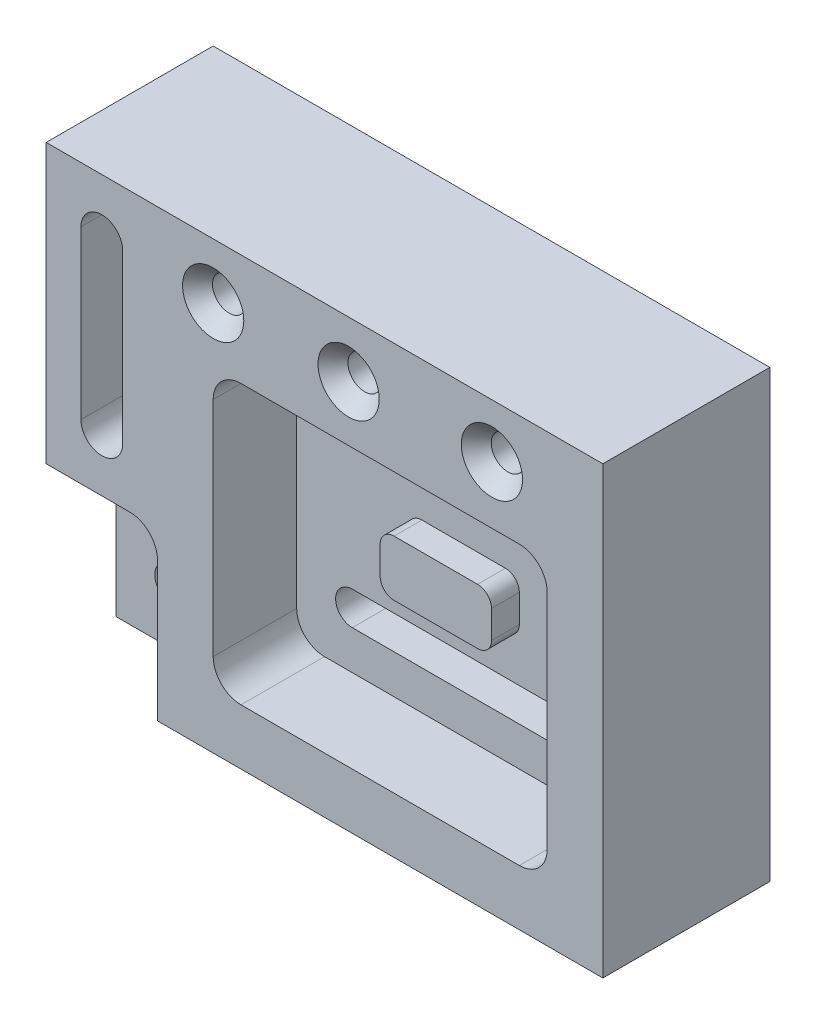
ISO-10303-21;
HEADER;
FILE_DESCRIPTION(('STEP AP214'),'2;1');
FILE_NAME('part.step','',(''),(''),'','','');
FILE_SCHEMA(('AUTOMOTIVE_DESIGN { 1 0 10303 214 1 1 1 1 }'));
ENDSEC;
DATA;
#1=APPLICATION_CONTEXT('core data for automotive mechanical design processes');
#2=APPLICATION_PROTOCOL_DEFINITION('international standard','automotive_design',2000,#1);
#3=PRODUCT_CONTEXT('',#1,'mechanical');
#4=PRODUCT('Part','Part','',(#3));
#5=PRODUCT_RELATED_PRODUCT_CATEGORY('part','',(#4));
#6=PRODUCT_DEFINITION_FORMATION('','',#4);
#7=PRODUCT_DEFINITION_CONTEXT('part definition',#1,'design');
#8=PRODUCT_DEFINITION('design','',#6,#7);
#9=PRODUCT_DEFINITION_SHAPE('','',#8);
#10=(LENGTH_UNIT() NAMED_UNIT(*) SI_UNIT(.MILLI.,.METRE.));
#11=(NAMED_UNIT(*) PLANE_ANGLE_UNIT() SI_UNIT($,.RADIAN.));
#12=(NAMED_UNIT(*) SI_UNIT($,.STERADIAN.) SOLID_ANGLE_UNIT());
#13=UNCERTAINTY_MEASURE_WITH_UNIT(LENGTH_MEASURE(1.E-05),#10,'distance_accuracy_value','');
#14=(GEOMETRIC_REPRESENTATION_CONTEXT(3) GLOBAL_UNCERTAINTY_ASSIGNED_CONTEXT((#13)) GLOBAL_UNIT_ASSIGNED_CONTEXT((#10,
#11,#12)) REPRESENTATION_CONTEXT('',''));
#15=CARTESIAN_POINT('',(0.,0.,0.));
#16=DIRECTION('',(0.,0.,1.));
#17=DIRECTION('',(1.,0.,0.));
#18=AXIS2_PLACEMENT_3D('',#15,#16,#17);
#19=CARTESIAN_POINT('',(70.,30.,-30.));
#20=DIRECTION('',(0.,0.,1.));
#21=DIRECTION('',(1.,0.,0.));
#22=AXIS2_PLACEMENT_3D('',#19,#20,#21);
#23=PLANE('',#22);
#24=CARTESIAN_POINT('',(70.,30.,-30.));
#25=DIRECTION('',(0.,0.,1.));
#26=DIRECTION('',(1.,0.,0.));
#27=AXIS2_PLACEMENT_3D('',#24,#25,#26);
#28=CIRCLE('',#27,10.);
#29=CARTESIAN_POINT('',(80.,29.9999999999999,-30.));
#30=VERTEX_POINT('',#29);
#31=CARTESIAN_POINT('',(69.9999999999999,40.,-30.));
#32=VERTEX_POINT('',#31);
#33=EDGE_CURVE('E890',#30,#32,#28,.T.);
#34=ORIENTED_EDGE('',*,*,#33,.T.);
#35=DIRECTION('',(1.,0.,0.));
#36=VECTOR('',#35,1.);
#37=CARTESIAN_POINT('',(-29.9999999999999,40.,-30.));
#38=LINE('',#37,#36);
#39=CARTESIAN_POINT('',(-29.9999999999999,40.,-30.));
#40=VERTEX_POINT('',#39);
#41=EDGE_CURVE('E896',#40,#32,#38,.T.);
#42=ORIENTED_EDGE('',*,*,#41,.F.);
#43=CARTESIAN_POINT('',(-30.,30.,-30.));
#44=DIRECTION('',(0.,0.,-1.));
#45=DIRECTION('',(-1.,0.,0.));
#46=AXIS2_PLACEMENT_3D('',#43,#44,#45);
#47=CIRCLE('',#46,10.);
#48=CARTESIAN_POINT('',(-40.,29.9999999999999,-30.));
#49=VERTEX_POINT('',#48);
#50=EDGE_CURVE('E947',#49,#40,#47,.T.);
#51=ORIENTED_EDGE('',*,*,#50,.F.);
#52=DIRECTION('',(0.,-1.,0.));
#53=VECTOR('',#52,1.);
#54=CARTESIAN_POINT('',(-40.,29.9999999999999,-30.));
#55=LINE('',#54,#53);
#56=CARTESIAN_POINT('',(-40.,-49.9999999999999,-30.));
#57=VERTEX_POINT('',#56);
#58=EDGE_CURVE('E944',#49,#57,#55,.T.);
#59=ORIENTED_EDGE('',*,*,#58,.T.);
#60=CARTESIAN_POINT('',(-30.,-50.,-30.));
#61=DIRECTION('',(0.,0.,-1.));
#62=DIRECTION('',(-1.,0.,0.));
#63=AXIS2_PLACEMENT_3D('',#60,#61,#62);
#64=CIRCLE('',#63,10.);
#65=CARTESIAN_POINT('',(-29.9999999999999,-60.,-30.));
#66=VERTEX_POINT('',#65);
#67=EDGE_CURVE('E926',#66,#57,#64,.T.);
#68=ORIENTED_EDGE('',*,*,#67,.F.);
#69=DIRECTION('',(-1.,0.,0.));
#70=VECTOR('',#69,1.);
#71=CARTESIAN_POINT('',(69.9999999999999,-60.,-30.));
#72=LINE('',#71,#70);
#73=CARTESIAN_POINT('',(69.9999999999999,-60.,-30.));
#74=VERTEX_POINT('',#73);
#75=EDGE_CURVE('E923',#74,#66,#72,.T.);
#76=ORIENTED_EDGE('',*,*,#75,.F.);
#77=CARTESIAN_POINT('',(70.,-50.,-30.));
#78=DIRECTION('',(0.,0.,-1.));
#79=DIRECTION('',(-1.,0.,0.));
#80=AXIS2_PLACEMENT_3D('',#77,#78,#79);
#81=CIRCLE('',#80,10.);
#82=CARTESIAN_POINT('',(80.,-49.9999999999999,-30.));
#83=VERTEX_POINT('',#82);
#84=EDGE_CURVE('E920',#83,#74,#81,.T.);
#85=ORIENTED_EDGE('',*,*,#84,.F.);
#86=DIRECTION('',(0.,1.,0.));
#87=VECTOR('',#86,1.);
#88=CARTESIAN_POINT('',(80.,-49.9999999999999,-30.));
#89=LINE('',#88,#87);
#90=EDGE_CURVE('E909',#83,#30,#89,.T.);
#91=ORIENTED_EDGE('',*,*,#90,.T.);
#92=EDGE_LOOP('',(#34,#42,#51,#59,#68,#76,#85,#91));
#93=FACE_BOUND('',#92,.T.);
#94=CARTESIAN_POINT('',(-20.,20.,-30.));
#95=DIRECTION('',(0.,0.,1.));
#96=DIRECTION('',(1.,0.,0.));
#97=AXIS2_PLACEMENT_3D('',#94,#95,#96);
#98=CIRCLE('',#97,6.);
#99=CARTESIAN_POINT('',(-20.,26.,-30.));
#100=VERTEX_POINT('',#99);
#101=CARTESIAN_POINT('',(-20.,14.,-30.));
#102=VERTEX_POINT('',#101);
#103=EDGE_CURVE('E703',#100,#102,#98,.T.);
#104=ORIENTED_EDGE('',*,*,#103,.F.);
#105=DIRECTION('',(1.,0.,0.));
#106=VECTOR('',#105,1.);
#107=CARTESIAN_POINT('',(-20.,26.,-30.));
#108=LINE('',#107,#106);
#109=CARTESIAN_POINT('',(60.1483933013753,26.,-30.));
#110=VERTEX_POINT('',#109);
#111=EDGE_CURVE('E678',#100,#110,#108,.T.);
#112=ORIENTED_EDGE('',*,*,#111,.T.);
#113=CARTESIAN_POINT('',(60.1483933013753,20.,-30.));
#114=DIRECTION('',(0.,0.,1.));
#115=DIRECTION('',(1.,0.,0.));
#116=AXIS2_PLACEMENT_3D('',#113,#114,#115);
#117=CIRCLE('',#116,6.);
#118=CARTESIAN_POINT('',(60.1483933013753,14.,-30.));
#119=VERTEX_POINT('',#118);
#120=EDGE_CURVE('E710',#119,#110,#117,.T.);
#121=ORIENTED_EDGE('',*,*,#120,.F.);
#122=DIRECTION('',(1.,0.,0.));
#123=VECTOR('',#122,1.);
#124=CARTESIAN_POINT('',(-20.,14.,-30.));
#125=LINE('',#124,#123);
#126=EDGE_CURVE('E706',#102,#119,#125,.T.);
#127=ORIENTED_EDGE('',*,*,#126,.F.);
#128=EDGE_LOOP('',(#104,#112,#121,#127));
#129=FACE_BOUND('',#128,.T.);
#130=CARTESIAN_POINT('',(-20.,-40.,-30.));
#131=DIRECTION('',(0.,0.,1.));
#132=DIRECTION('',(1.,0.,0.));
#133=AXIS2_PLACEMENT_3D('',#130,#131,#132);
#134=CIRCLE('',#133,6.);
#135=CARTESIAN_POINT('',(-20.,-34.,-30.));
#136=VERTEX_POINT('',#135);
#137=CARTESIAN_POINT('',(-20.,-46.,-30.));
#138=VERTEX_POINT('',#137);
#139=EDGE_CURVE('E283',#136,#138,#134,.T.);
#140=ORIENTED_EDGE('',*,*,#139,.F.);
#141=DIRECTION('',(1.,0.,0.));
#142=VECTOR('',#141,1.);
#143=CARTESIAN_POINT('',(-20.,-34.,-30.));
#144=LINE('',#143,#142);
#145=CARTESIAN_POINT('',(60.1483933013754,-34.,-30.));
#146=VERTEX_POINT('',#145);
#147=EDGE_CURVE('E719',#136,#146,#144,.T.);
#148=ORIENTED_EDGE('',*,*,#147,.T.);
#149=CARTESIAN_POINT('',(60.1483933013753,-40.,-30.));
#150=DIRECTION('',(0.,0.,1.));
#151=DIRECTION('',(1.,0.,0.));
#152=AXIS2_PLACEMENT_3D('',#149,#150,#151);
#153=CIRCLE('',#152,6.00000000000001);
#154=CARTESIAN_POINT('',(60.1483933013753,-46.,-30.));
#155=VERTEX_POINT('',#154);
#156=EDGE_CURVE('E723',#155,#146,#153,.T.);
#157=ORIENTED_EDGE('',*,*,#156,.F.);
#158=DIRECTION('',(1.,0.,0.));
#159=VECTOR('',#158,1.);
#160=CARTESIAN_POINT('',(-20.,-46.,-30.));
#161=LINE('',#160,#159);
#162=EDGE_CURVE('E754',#138,#155,#161,.T.);
#163=ORIENTED_EDGE('',*,*,#162,.F.);
#164=EDGE_LOOP('',(#140,#148,#157,#163));
#165=FACE_BOUND('',#164,.T.);
#166=DIRECTION('',(1.,0.,0.));
#167=VECTOR('',#166,1.);
#168=CARTESIAN_POINT('',(5.00000000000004,0.,-30.));
#169=LINE('',#168,#167);
#170=CARTESIAN_POINT('',(5.00000000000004,0.,-30.));
#171=VERTEX_POINT('',#170);
#172=CARTESIAN_POINT('',(35.,0.,-30.));
#173=VERTEX_POINT('',#172);
#174=EDGE_CURVE('E277',#171,#173,#169,.T.);
#175=ORIENTED_EDGE('',*,*,#174,.T.);
#176=CARTESIAN_POINT('',(35.,-5.,-30.));
#177=DIRECTION('',(0.,0.,1.));
#178=DIRECTION('',(1.,0.,0.));
#179=AXIS2_PLACEMENT_3D('',#176,#177,#178);
#180=CIRCLE('',#179,5.);
#181=CARTESIAN_POINT('',(40.,-5.00000000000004,-30.));
#182=VERTEX_POINT('',#181);
#183=EDGE_CURVE('E288',#182,#173,#180,.T.);
#184=ORIENTED_EDGE('',*,*,#183,.F.);
#185=DIRECTION('',(0.,1.,0.));
#186=VECTOR('',#185,1.);
#187=CARTESIAN_POINT('',(40.,-15.,-30.));
#188=LINE('',#187,#186);
#189=CARTESIAN_POINT('',(40.,-15.,-30.));
#190=VERTEX_POINT('',#189);
#191=EDGE_CURVE('E330',#190,#182,#188,.T.);
#192=ORIENTED_EDGE('',*,*,#191,.F.);
#193=CARTESIAN_POINT('',(35.,-15.,-30.));
#194=DIRECTION('',(0.,0.,-1.));
#195=DIRECTION('',(-1.,0.,0.));
#196=AXIS2_PLACEMENT_3D('',#193,#194,#195);
#197=CIRCLE('',#196,5.);
#198=CARTESIAN_POINT('',(35.,-20.,-30.));
#199=VERTEX_POINT('',#198);
#200=EDGE_CURVE('E54',#190,#199,#197,.T.);
#201=ORIENTED_EDGE('',*,*,#200,.T.);
#202=DIRECTION('',(-1.,0.,0.));
#203=VECTOR('',#202,1.);
#204=CARTESIAN_POINT('',(35.,-20.,-30.));
#205=LINE('',#204,#203);
#206=CARTESIAN_POINT('',(5.00000000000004,-20.,-30.));
#207=VERTEX_POINT('',#206);
#208=EDGE_CURVE('E319',#199,#207,#205,.T.);
#209=ORIENTED_EDGE('',*,*,#208,.T.);
#210=CARTESIAN_POINT('',(5.,-15.,-30.));
#211=DIRECTION('',(0.,0.,-1.));
#212=DIRECTION('',(-1.,0.,0.));
#213=AXIS2_PLACEMENT_3D('',#210,#211,#212);
#214=CIRCLE('',#213,5.);
#215=CARTESIAN_POINT('',(0.,-15.,-30.));
#216=VERTEX_POINT('',#215);
#217=EDGE_CURVE('E315',#207,#216,#214,.T.);
#218=ORIENTED_EDGE('',*,*,#217,.T.);
#219=DIRECTION('',(0.,-1.,0.));
#220=VECTOR('',#219,1.);
#221=CARTESIAN_POINT('',(0.,-5.00000000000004,-30.));
#222=LINE('',#221,#220);
#223=CARTESIAN_POINT('',(0.,-5.00000000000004,-30.));
#224=VERTEX_POINT('',#223);
#225=EDGE_CURVE('E299',#224,#216,#222,.T.);
#226=ORIENTED_EDGE('',*,*,#225,.F.);
#227=CARTESIAN_POINT('',(5.,-5.,-30.));
#228=DIRECTION('',(0.,0.,-1.));
#229=DIRECTION('',(-1.,0.,0.));
#230=AXIS2_PLACEMENT_3D('',#227,#228,#229);
#231=CIRCLE('',#230,5.);
#232=EDGE_CURVE('E297',#224,#171,#231,.T.);
#233=ORIENTED_EDGE('',*,*,#232,.T.);
#234=EDGE_LOOP('',(#175,#184,#192,#201,#209,#218,#226,#233));
#235=FACE_BOUND('',#234,.T.);
#236=ADVANCED_FACE('F39',(#93,#129,#165,#235),#23,.T.);
#237=CARTESIAN_POINT('',(-100.,-80.,0.));
#238=DIRECTION('',(0.,0.,-1.));
#239=DIRECTION('',(-1.,0.,0.));
#240=AXIS2_PLACEMENT_3D('',#237,#238,#239);
#241=PLANE('',#240);
#242=DIRECTION('',(0.,-1.,0.));
#243=VECTOR('',#242,1.);
#244=CARTESIAN_POINT('',(-87.5000000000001,60.,0.));
#245=LINE('',#244,#243);
#246=CARTESIAN_POINT('',(-87.5000000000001,60.,0.));
#247=VERTEX_POINT('',#246);
#248=CARTESIAN_POINT('',(-87.5000000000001,0.,0.));
#249=VERTEX_POINT('',#248);
#250=EDGE_CURVE('E634',#247,#249,#245,.T.);
#251=ORIENTED_EDGE('',*,*,#250,.F.);
#252=CARTESIAN_POINT('',(-80.0000000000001,60.,0.));
#253=DIRECTION('',(0.,0.,1.));
#254=DIRECTION('',(1.,0.,0.));
#255=AXIS2_PLACEMENT_3D('',#252,#253,#254);
#256=CIRCLE('',#255,7.49999999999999);
#257=CARTESIAN_POINT('',(-72.5000000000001,60.,0.));
#258=VERTEX_POINT('',#257);
#259=EDGE_CURVE('E630',#258,#247,#256,.T.);
#260=ORIENTED_EDGE('',*,*,#259,.F.);
#261=DIRECTION('',(0.,-1.,0.));
#262=VECTOR('',#261,1.);
#263=CARTESIAN_POINT('',(-72.5000000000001,60.,0.));
#264=LINE('',#263,#262);
#265=CARTESIAN_POINT('',(-72.5,0.,0.));
#266=VERTEX_POINT('',#265);
#267=EDGE_CURVE('E655',#258,#266,#264,.T.);
#268=ORIENTED_EDGE('',*,*,#267,.T.);
#269=CARTESIAN_POINT('',(-80.,0.,0.));
#270=DIRECTION('',(0.,0.,1.));
#271=DIRECTION('',(1.,0.,0.));
#272=AXIS2_PLACEMENT_3D('',#269,#270,#271);
#273=CIRCLE('',#272,7.50000000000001);
#274=EDGE_CURVE('E642',#249,#266,#273,.T.);
#275=ORIENTED_EDGE('',*,*,#274,.F.);
#276=EDGE_LOOP('',(#251,#260,#268,#275));
#277=FACE_BOUND('',#276,.T.);
#278=CARTESIAN_POINT('',(8.66393965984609,59.8722747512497,-5.6843418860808E-11));
#279=DIRECTION('',(0.,0.,1.));
#280=DIRECTION('',(1.,0.,0.));
#281=AXIS2_PLACEMENT_3D('',#278,#279,#280);
#282=CIRCLE('',#281,11.);
#283=CARTESIAN_POINT('',(19.6639396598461,59.8722747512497,-5.6843418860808E-11));
#284=VERTEX_POINT('',#283);
#285=EDGE_CURVE('E584',#284,#284,#282,.T.);
#286=ORIENTED_EDGE('',*,*,#285,.F.);
#287=EDGE_LOOP('',(#286));
#288=FACE_BOUND('',#287,.T.);
#289=DIRECTION('',(1.,0.,0.));
#290=VECTOR('',#289,1.);
#291=CARTESIAN_POINT('',(-120.,-20.,0.));
#292=LINE('',#291,#290);
#293=CARTESIAN_POINT('',(-100.,-20.,0.));
#294=VERTEX_POINT('',#293);
#295=CARTESIAN_POINT('',(-70.0000000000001,-20.,0.));
#296=VERTEX_POINT('',#295);
#297=EDGE_CURVE('E560',#294,#296,#292,.T.);
#298=ORIENTED_EDGE('',*,*,#297,.T.);
#299=CARTESIAN_POINT('',(-70.,-30.,0.));
#300=DIRECTION('',(0.,0.,1.));
#301=DIRECTION('',(1.,0.,0.));
#302=AXIS2_PLACEMENT_3D('',#299,#300,#301);
#303=CIRCLE('',#302,10.);
#304=CARTESIAN_POINT('',(-60.,-30.0000000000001,0.));
#305=VERTEX_POINT('',#304);
#306=EDGE_CURVE('E553',#305,#296,#303,.T.);
#307=ORIENTED_EDGE('',*,*,#306,.F.);
#308=DIRECTION('',(0.,1.,0.));
#309=VECTOR('',#308,1.);
#310=CARTESIAN_POINT('',(-60.,-100.,0.));
#311=LINE('',#310,#309);
#312=CARTESIAN_POINT('',(-60.,-80.,0.));
#313=VERTEX_POINT('',#312);
#314=EDGE_CURVE('E549',#313,#305,#311,.T.);
#315=ORIENTED_EDGE('',*,*,#314,.F.);
#316=DIRECTION('',(-1.,0.,0.));
#317=VECTOR('',#316,1.);
#318=CARTESIAN_POINT('',(100.,-80.,0.));
#319=LINE('',#318,#317);
#320=CARTESIAN_POINT('',(100.,-80.,0.));
#321=VERTEX_POINT('',#320);
#322=EDGE_CURVE('E496',#321,#313,#319,.T.);
#323=ORIENTED_EDGE('',*,*,#322,.F.);
#324=DIRECTION('',(0.,1.,0.));
#325=VECTOR('',#324,1.);
#326=CARTESIAN_POINT('',(100.,-80.,0.));
#327=LINE('',#326,#325);
#328=CARTESIAN_POINT('',(100.,80.,0.));
#329=VERTEX_POINT('',#328);
#330=EDGE_CURVE('E505',#321,#329,#327,.T.);
#331=ORIENTED_EDGE('',*,*,#330,.T.);
#332=DIRECTION('',(1.,0.,0.));
#333=VECTOR('',#332,1.);
#334=CARTESIAN_POINT('',(-100.,80.,0.));
#335=LINE('',#334,#333);
#336=CARTESIAN_POINT('',(-100.,80.,0.));
#337=VERTEX_POINT('',#336);
#338=EDGE_CURVE('E509',#337,#329,#335,.T.);
#339=ORIENTED_EDGE('',*,*,#338,.F.);
#340=DIRECTION('',(0.,-1.,0.));
#341=VECTOR('',#340,1.);
#342=CARTESIAN_POINT('',(-100.,80.,0.));
#343=LINE('',#342,#341);
#344=EDGE_CURVE('E506',#337,#294,#343,.T.);
#345=ORIENTED_EDGE('',*,*,#344,.T.);
#346=EDGE_LOOP('',(#298,#307,#315,#323,#331,#339,#345));
#347=FACE_BOUND('',#346,.T.);
#348=DIRECTION('',(1.,0.,0.));
#349=VECTOR('',#348,1.);
#350=CARTESIAN_POINT('',(-29.9999999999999,40.,0.));
#351=LINE('',#350,#349);
#352=CARTESIAN_POINT('',(-29.9999999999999,40.,0.));
#353=VERTEX_POINT('',#352);
#354=CARTESIAN_POINT('',(69.9999999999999,40.,0.));
#355=VERTEX_POINT('',#354);
#356=EDGE_CURVE('E531',#353,#355,#351,.T.);
#357=ORIENTED_EDGE('',*,*,#356,.T.);
#358=CARTESIAN_POINT('',(70.,30.,0.));
#359=DIRECTION('',(0.,0.,1.));
#360=DIRECTION('',(1.,0.,0.));
#361=AXIS2_PLACEMENT_3D('',#358,#359,#360);
#362=CIRCLE('',#361,10.);
#363=CARTESIAN_POINT('',(80.,29.9999999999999,0.));
#364=VERTEX_POINT('',#363);
#365=EDGE_CURVE('E527',#364,#355,#362,.T.);
#366=ORIENTED_EDGE('',*,*,#365,.F.);
#367=DIRECTION('',(0.,1.,0.));
#368=VECTOR('',#367,1.);
#369=CARTESIAN_POINT('',(80.,-49.9999999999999,0.));
#370=LINE('',#369,#368);
#371=CARTESIAN_POINT('',(80.,-49.9999999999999,0.));
#372=VERTEX_POINT('',#371);
#373=EDGE_CURVE('E885',#372,#364,#370,.T.);
#374=ORIENTED_EDGE('',*,*,#373,.F.);
#375=CARTESIAN_POINT('',(70.,-50.,0.));
#376=DIRECTION('',(0.,0.,-1.));
#377=DIRECTION('',(-1.,0.,0.));
#378=AXIS2_PLACEMENT_3D('',#375,#376,#377);
#379=CIRCLE('',#378,10.);
#380=CARTESIAN_POINT('',(69.9999999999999,-60.,0.));
#381=VERTEX_POINT('',#380);
#382=EDGE_CURVE('E891',#372,#381,#379,.T.);
#383=ORIENTED_EDGE('',*,*,#382,.T.);
#384=DIRECTION('',(-1.,0.,0.));
#385=VECTOR('',#384,1.);
#386=CARTESIAN_POINT('',(69.9999999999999,-60.,0.));
#387=LINE('',#386,#385);
#388=CARTESIAN_POINT('',(-29.9999999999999,-60.,0.));
#389=VERTEX_POINT('',#388);
#390=EDGE_CURVE('E985',#381,#389,#387,.T.);
#391=ORIENTED_EDGE('',*,*,#390,.T.);
#392=CARTESIAN_POINT('',(-30.,-50.,0.));
#393=DIRECTION('',(0.,0.,-1.));
#394=DIRECTION('',(-1.,0.,0.));
#395=AXIS2_PLACEMENT_3D('',#392,#393,#394);
#396=CIRCLE('',#395,10.);
#397=CARTESIAN_POINT('',(-40.,-49.9999999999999,0.));
#398=VERTEX_POINT('',#397);
#399=EDGE_CURVE('E981',#389,#398,#396,.T.);
#400=ORIENTED_EDGE('',*,*,#399,.T.);
#401=DIRECTION('',(0.,-1.,0.));
#402=VECTOR('',#401,1.);
#403=CARTESIAN_POINT('',(-40.,29.9999999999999,0.));
#404=LINE('',#403,#402);
#405=CARTESIAN_POINT('',(-40.,29.9999999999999,0.));
#406=VERTEX_POINT('',#405);
#407=EDGE_CURVE('E977',#406,#398,#404,.T.);
#408=ORIENTED_EDGE('',*,*,#407,.F.);
#409=CARTESIAN_POINT('',(-30.,30.,0.));
#410=DIRECTION('',(0.,0.,-1.));
#411=DIRECTION('',(-1.,0.,0.));
#412=AXIS2_PLACEMENT_3D('',#409,#410,#411);
#413=CIRCLE('',#412,10.);
#414=EDGE_CURVE('E538',#406,#353,#413,.T.);
#415=ORIENTED_EDGE('',*,*,#414,.T.);
#416=EDGE_LOOP('',(#357,#366,#374,#383,#391,#400,#408,#415));
#417=FACE_BOUND('',#416,.T.);
#418=CARTESIAN_POINT('',(-40.,60.,0.));
#419=DIRECTION('',(0.,0.,1.));
#420=DIRECTION('',(1.,0.,0.));
#421=AXIS2_PLACEMENT_3D('',#418,#419,#420);
#422=CIRCLE('',#421,11.);
#423=CARTESIAN_POINT('',(-29.,60.,0.));
#424=VERTEX_POINT('',#423);
#425=EDGE_CURVE('E570',#424,#424,#422,.T.);
#426=ORIENTED_EDGE('',*,*,#425,.F.);
#427=EDGE_LOOP('',(#426));
#428=FACE_BOUND('',#427,.T.);
#429=CARTESIAN_POINT('',(60.1483933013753,60.6571498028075,0.));
#430=DIRECTION('',(0.,0.,1.));
#431=DIRECTION('',(1.,0.,0.));
#432=AXIS2_PLACEMENT_3D('',#429,#430,#431);
#433=CIRCLE('',#432,11.);
#434=CARTESIAN_POINT('',(71.1483933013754,60.6571498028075,0.));
#435=VERTEX_POINT('',#434);
#436=EDGE_CURVE('E598',#435,#435,#433,.T.);
#437=ORIENTED_EDGE('',*,*,#436,.F.);
#438=EDGE_LOOP('',(#437));
#439=FACE_BOUND('',#438,.T.);
#440=ADVANCED_FACE('F431',(#277,#288,#347,#417,#428,#439),#241,.F.);
#441=CARTESIAN_POINT('',(-100.,-80.,-60.));
#442=DIRECTION('',(0.,0.,-1.));
#443=DIRECTION('',(-1.,0.,0.));
#444=AXIS2_PLACEMENT_3D('',#441,#442,#443);
#445=PLANE('',#444);
#446=CARTESIAN_POINT('',(-20.,-40.,-60.0000000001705));
#447=DIRECTION('',(0.,0.,1.));
#448=DIRECTION('',(1.,0.,0.));
#449=AXIS2_PLACEMENT_3D('',#446,#447,#448);
#450=CIRCLE('',#449,6.);
#451=CARTESIAN_POINT('',(-20.,-34.,-60.0000000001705));
#452=VERTEX_POINT('',#451);
#453=CARTESIAN_POINT('',(-20.,-46.,-60.0000000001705));
#454=VERTEX_POINT('',#453);
#455=EDGE_CURVE('E722',#452,#454,#450,.T.);
#456=ORIENTED_EDGE('',*,*,#455,.T.);
#457=DIRECTION('',(1.,0.,0.));
#458=VECTOR('',#457,1.);
#459=CARTESIAN_POINT('',(-20.,-46.,-60.0000000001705));
#460=LINE('',#459,#458);
#461=CARTESIAN_POINT('',(60.1483933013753,-46.,-60.));
#462=VERTEX_POINT('',#461);
#463=EDGE_CURVE('E727',#454,#462,#460,.T.);
#464=ORIENTED_EDGE('',*,*,#463,.T.);
#465=CARTESIAN_POINT('',(60.1483933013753,-40.,-60.0000000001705));
#466=DIRECTION('',(0.,0.,1.));
#467=DIRECTION('',(1.,0.,0.));
#468=AXIS2_PLACEMENT_3D('',#465,#466,#467);
#469=CIRCLE('',#468,6.00000000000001);
#470=CARTESIAN_POINT('',(60.1483933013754,-34.,-60.0000000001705));
#471=VERTEX_POINT('',#470);
#472=EDGE_CURVE('E62',#462,#471,#469,.T.);
#473=ORIENTED_EDGE('',*,*,#472,.T.);
#474=DIRECTION('',(1.,0.,0.));
#475=VECTOR('',#474,1.);
#476=CARTESIAN_POINT('',(-20.,-34.,-60.0000000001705));
#477=LINE('',#476,#475);
#478=EDGE_CURVE('E700',#452,#471,#477,.T.);
#479=ORIENTED_EDGE('',*,*,#478,.F.);
#480=EDGE_LOOP('',(#456,#464,#473,#479));
#481=FACE_BOUND('',#480,.T.);
#482=CARTESIAN_POINT('',(-20.,20.,-60.0000000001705));
#483=DIRECTION('',(0.,0.,1.));
#484=DIRECTION('',(1.,0.,0.));
#485=AXIS2_PLACEMENT_3D('',#482,#483,#484);
#486=CIRCLE('',#485,6.);
#487=CARTESIAN_POINT('',(-20.,26.,-60.0000000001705));
#488=VERTEX_POINT('',#487);
#489=CARTESIAN_POINT('',(-20.,14.,-60.0000000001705));
#490=VERTEX_POINT('',#489);
#491=EDGE_CURVE('E672',#488,#490,#486,.T.);
#492=ORIENTED_EDGE('',*,*,#491,.T.);
#493=DIRECTION('',(1.,0.,0.));
#494=VECTOR('',#493,1.);
#495=CARTESIAN_POINT('',(-20.,14.,-60.0000000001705));
#496=LINE('',#495,#494);
#497=CARTESIAN_POINT('',(60.1483933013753,14.,-60.));
#498=VERTEX_POINT('',#497);
#499=EDGE_CURVE('E677',#490,#498,#496,.T.);
#500=ORIENTED_EDGE('',*,*,#499,.T.);
#501=CARTESIAN_POINT('',(60.1483933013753,20.,-60.0000000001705));
#502=DIRECTION('',(0.,0.,1.));
#503=DIRECTION('',(1.,0.,0.));
#504=AXIS2_PLACEMENT_3D('',#501,#502,#503);
#505=CIRCLE('',#504,6.);
#506=CARTESIAN_POINT('',(60.1483933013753,26.,-60.0000000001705));
#507=VERTEX_POINT('',#506);
#508=EDGE_CURVE('E684',#498,#507,#505,.T.);
#509=ORIENTED_EDGE('',*,*,#508,.T.);
#510=DIRECTION('',(1.,0.,0.));
#511=VECTOR('',#510,1.);
#512=CARTESIAN_POINT('',(-20.,26.,-60.0000000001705));
#513=LINE('',#512,#511);
#514=EDGE_CURVE('E1457',#488,#507,#513,.T.);
#515=ORIENTED_EDGE('',*,*,#514,.F.);
#516=EDGE_LOOP('',(#492,#500,#509,#515));
#517=FACE_BOUND('',#516,.T.);
#518=CARTESIAN_POINT('',(-80.,-60.,-60.0000000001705));
#519=DIRECTION('',(0.,0.,1.));
#520=DIRECTION('',(1.,0.,0.));
#521=AXIS2_PLACEMENT_3D('',#518,#519,#520);
#522=CIRCLE('',#521,6.);
#523=CARTESIAN_POINT('',(-74.,-60.,-60.0000000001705));
#524=VERTEX_POINT('',#523);
#525=EDGE_CURVE('E613',#524,#524,#522,.T.);
#526=ORIENTED_EDGE('',*,*,#525,.T.);
#527=EDGE_LOOP('',(#526));
#528=FACE_BOUND('',#527,.T.);
#529=CARTESIAN_POINT('',(-80.,-33.3333333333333,-60.0000000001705));
#530=DIRECTION('',(0.,0.,1.));
#531=DIRECTION('',(1.,0.,0.));
#532=AXIS2_PLACEMENT_3D('',#529,#530,#531);
#533=CIRCLE('',#532,6.);
#534=CARTESIAN_POINT('',(-74.,-33.3333333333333,-60.0000000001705));
#535=VERTEX_POINT('',#534);
#536=EDGE_CURVE('E602',#535,#535,#533,.T.);
#537=ORIENTED_EDGE('',*,*,#536,.T.);
#538=EDGE_LOOP('',(#537));
#539=FACE_BOUND('',#538,.T.);
#540=CARTESIAN_POINT('',(8.66393965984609,59.8722747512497,-60.0000000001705));
#541=DIRECTION('',(0.,0.,1.));
#542=DIRECTION('',(1.,0.,0.));
#543=AXIS2_PLACEMENT_3D('',#540,#541,#542);
#544=CIRCLE('',#543,6.);
#545=CARTESIAN_POINT('',(14.6639396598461,59.8722747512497,-60.0000000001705));
#546=VERTEX_POINT('',#545);
#547=EDGE_CURVE('E574',#546,#546,#544,.T.);
#548=ORIENTED_EDGE('',*,*,#547,.T.);
#549=EDGE_LOOP('',(#548));
#550=FACE_BOUND('',#549,.T.);
#551=DIRECTION('',(0.,-1.,0.));
#552=VECTOR('',#551,1.);
#553=CARTESIAN_POINT('',(-100.,80.,-60.));
#554=LINE('',#553,#552);
#555=CARTESIAN_POINT('',(-100.,80.,-60.));
#556=VERTEX_POINT('',#555);
#557=CARTESIAN_POINT('',(-100.,-80.,-60.));
#558=VERTEX_POINT('',#557);
#559=EDGE_CURVE('E775',#556,#558,#554,.T.);
#560=ORIENTED_EDGE('',*,*,#559,.F.);
#561=DIRECTION('',(1.,0.,0.));
#562=VECTOR('',#561,1.);
#563=CARTESIAN_POINT('',(-100.,80.,-60.));
#564=LINE('',#563,#562);
#565=CARTESIAN_POINT('',(100.,80.,-60.));
#566=VERTEX_POINT('',#565);
#567=EDGE_CURVE('E866',#556,#566,#564,.T.);
#568=ORIENTED_EDGE('',*,*,#567,.T.);
#569=DIRECTION('',(0.,1.,0.));
#570=VECTOR('',#569,1.);
#571=CARTESIAN_POINT('',(100.,-80.,-60.));
#572=LINE('',#571,#570);
#573=CARTESIAN_POINT('',(100.,-80.,-60.));
#574=VERTEX_POINT('',#573);
#575=EDGE_CURVE('E1005',#574,#566,#572,.T.);
#576=ORIENTED_EDGE('',*,*,#575,.F.);
#577=DIRECTION('',(-1.,0.,0.));
#578=VECTOR('',#577,1.);
#579=CARTESIAN_POINT('',(100.,-80.,-60.));
#580=LINE('',#579,#578);
#581=EDGE_CURVE('E1010',#574,#558,#580,.T.);
#582=ORIENTED_EDGE('',*,*,#581,.T.);
#583=EDGE_LOOP('',(#560,#568,#576,#582));
#584=FACE_BOUND('',#583,.T.);
#585=CARTESIAN_POINT('',(-40.,60.,-60.0000000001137));
#586=DIRECTION('',(0.,0.,1.));
#587=DIRECTION('',(1.,0.,0.));
#588=AXIS2_PLACEMENT_3D('',#585,#586,#587);
#589=CIRCLE('',#588,6.);
#590=CARTESIAN_POINT('',(-34.,60.,-60.0000000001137));
#591=VERTEX_POINT('',#590);
#592=EDGE_CURVE('E554',#591,#591,#589,.T.);
#593=ORIENTED_EDGE('',*,*,#592,.T.);
#594=EDGE_LOOP('',(#593));
#595=FACE_BOUND('',#594,.T.);
#596=CARTESIAN_POINT('',(60.1483933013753,60.6571498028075,-60.0000000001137));
#597=DIRECTION('',(0.,0.,1.));
#598=DIRECTION('',(1.,0.,0.));
#599=AXIS2_PLACEMENT_3D('',#596,#597,#598);
#600=CIRCLE('',#599,6.);
#601=CARTESIAN_POINT('',(66.1483933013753,60.6571498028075,-60.0000000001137));
#602=VERTEX_POINT('',#601);
#603=EDGE_CURVE('E588',#602,#602,#600,.T.);
#604=ORIENTED_EDGE('',*,*,#603,.T.);
#605=EDGE_LOOP('',(#604));
#606=FACE_BOUND('',#605,.T.);
#607=ADVANCED_FACE('F437',(#481,#517,#528,#539,#550,#584,#595,#606),#445,.T.);
#608=CARTESIAN_POINT('',(-100.,80.,-60.));
#609=DIRECTION('',(-1.,0.,0.));
#610=DIRECTION('',(0.,0.,1.));
#611=AXIS2_PLACEMENT_3D('',#608,#609,#610);
#612=PLANE('',#611);
#613=DIRECTION('',(0.,1.,0.));
#614=VECTOR('',#613,1.);
#615=CARTESIAN_POINT('',(-100.,80.,-25.));
#616=LINE('',#615,#614);
#617=CARTESIAN_POINT('',(-100.,-80.,-25.));
#618=VERTEX_POINT('',#617);
#619=CARTESIAN_POINT('',(-100.,-20.,-25.));
#620=VERTEX_POINT('',#619);
#621=EDGE_CURVE('E532',#618,#620,#616,.T.);
#622=ORIENTED_EDGE('',*,*,#621,.T.);
#623=DIRECTION('',(0.,0.,1.));
#624=VECTOR('',#623,1.);
#625=CARTESIAN_POINT('',(-100.,-20.,-60.));
#626=LINE('',#625,#624);
#627=EDGE_CURVE('E854',#620,#294,#626,.T.);
#628=ORIENTED_EDGE('',*,*,#627,.T.);
#629=ORIENTED_EDGE('',*,*,#344,.F.);
#630=DIRECTION('',(0.,0.,1.));
#631=VECTOR('',#630,1.);
#632=CARTESIAN_POINT('',(-100.,80.,-60.));
#633=LINE('',#632,#631);
#634=EDGE_CURVE('E47',#556,#337,#633,.T.);
#635=ORIENTED_EDGE('',*,*,#634,.F.);
#636=ORIENTED_EDGE('',*,*,#559,.T.);
#637=DIRECTION('',(0.,0.,1.));
#638=VECTOR('',#637,1.);
#639=CARTESIAN_POINT('',(-100.,-80.,-60.));
#640=LINE('',#639,#638);
#641=EDGE_CURVE('E999',#558,#618,#640,.T.);
#642=ORIENTED_EDGE('',*,*,#641,.T.);
#643=EDGE_LOOP('',(#622,#628,#629,#635,#636,#642));
#644=FACE_BOUND('',#643,.T.);
#645=ADVANCED_FACE('F41',(#644),#612,.T.);
#646=CARTESIAN_POINT('',(-100.,80.,-60.));
#647=DIRECTION('',(0.,-1.,0.));
#648=DIRECTION('',(0.,0.,-1.));
#649=AXIS2_PLACEMENT_3D('',#646,#647,#648);
#650=PLANE('',#649);
#651=ORIENTED_EDGE('',*,*,#338,.T.);
#652=DIRECTION('',(0.,0.,1.));
#653=VECTOR('',#652,1.);
#654=CARTESIAN_POINT('',(100.,80.,-60.));
#655=LINE('',#654,#653);
#656=EDGE_CURVE('E865',#566,#329,#655,.T.);
#657=ORIENTED_EDGE('',*,*,#656,.F.);
#658=ORIENTED_EDGE('',*,*,#567,.F.);
#659=ORIENTED_EDGE('',*,*,#634,.T.);
#660=EDGE_LOOP('',(#651,#657,#658,#659));
#661=FACE_BOUND('',#660,.T.);
#662=ADVANCED_FACE('F482',(#661),#650,.F.);
#663=CARTESIAN_POINT('',(100.,-80.,-60.));
#664=DIRECTION('',(1.,0.,0.));
#665=DIRECTION('',(0.,0.,-1.));
#666=AXIS2_PLACEMENT_3D('',#663,#664,#665);
#667=PLANE('',#666);
#668=ORIENTED_EDGE('',*,*,#330,.F.);
#669=DIRECTION('',(0.,0.,1.));
#670=VECTOR('',#669,1.);
#671=CARTESIAN_POINT('',(100.,-80.,-60.));
#672=LINE('',#671,#670);
#673=EDGE_CURVE('E500',#574,#321,#672,.T.);
#674=ORIENTED_EDGE('',*,*,#673,.F.);
#675=ORIENTED_EDGE('',*,*,#575,.T.);
#676=ORIENTED_EDGE('',*,*,#656,.T.);
#677=EDGE_LOOP('',(#668,#674,#675,#676));
#678=FACE_BOUND('',#677,.T.);
#679=ADVANCED_FACE('F485',(#678),#667,.T.);
#680=CARTESIAN_POINT('',(100.,-80.,-60.));
#681=DIRECTION('',(0.,1.,0.));
#682=DIRECTION('',(0.,0.,1.));
#683=AXIS2_PLACEMENT_3D('',#680,#681,#682);
#684=PLANE('',#683);
#685=ORIENTED_EDGE('',*,*,#322,.T.);
#686=DIRECTION('',(0.,0.,-1.));
#687=VECTOR('',#686,1.);
#688=CARTESIAN_POINT('',(-60.,-80.,-60.));
#689=LINE('',#688,#687);
#690=CARTESIAN_POINT('',(-60.,-80.,-25.));
#691=VERTEX_POINT('',#690);
#692=EDGE_CURVE('E498',#313,#691,#689,.T.);
#693=ORIENTED_EDGE('',*,*,#692,.T.);
#694=DIRECTION('',(1.,0.,0.));
#695=VECTOR('',#694,1.);
#696=CARTESIAN_POINT('',(100.,-80.,-25.));
#697=LINE('',#696,#695);
#698=EDGE_CURVE('E12',#618,#691,#697,.T.);
#699=ORIENTED_EDGE('',*,*,#698,.F.);
#700=ORIENTED_EDGE('',*,*,#641,.F.);
#701=ORIENTED_EDGE('',*,*,#581,.F.);
#702=ORIENTED_EDGE('',*,*,#673,.T.);
#703=EDGE_LOOP('',(#685,#693,#699,#700,#701,#702));
#704=FACE_BOUND('',#703,.T.);
#705=ADVANCED_FACE('F476',(#704),#684,.F.);
#706=CARTESIAN_POINT('',(70.,30.,-30.));
#707=DIRECTION('',(0.,0.,1.));
#708=DIRECTION('',(1.,0.,0.));
#709=AXIS2_PLACEMENT_3D('',#706,#707,#708);
#710=CYLINDRICAL_SURFACE('',#709,10.);
#711=ORIENTED_EDGE('',*,*,#365,.T.);
#712=DIRECTION('',(0.,0.,1.));
#713=VECTOR('',#712,1.);
#714=CARTESIAN_POINT('',(69.9999999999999,40.,-30.));
#715=LINE('',#714,#713);
#716=EDGE_CURVE('E952',#32,#355,#715,.T.);
#717=ORIENTED_EDGE('',*,*,#716,.F.);
#718=ORIENTED_EDGE('',*,*,#33,.F.);
#719=DIRECTION('',(0.,0.,1.));
#720=VECTOR('',#719,1.);
#721=CARTESIAN_POINT('',(80.,29.9999999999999,-30.));
#722=LINE('',#721,#720);
#723=EDGE_CURVE('E512',#30,#364,#722,.T.);
#724=ORIENTED_EDGE('',*,*,#723,.T.);
#725=EDGE_LOOP('',(#711,#717,#718,#724));
#726=FACE_BOUND('',#725,.T.);
#727=ADVANCED_FACE('F450',(#726),#710,.F.);
#728=CARTESIAN_POINT('',(80.,-49.9999999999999,-30.));
#729=DIRECTION('',(1.,0.,0.));
#730=DIRECTION('',(0.,0.,-1.));
#731=AXIS2_PLACEMENT_3D('',#728,#729,#730);
#732=PLANE('',#731);
#733=ORIENTED_EDGE('',*,*,#373,.T.);
#734=ORIENTED_EDGE('',*,*,#723,.F.);
#735=ORIENTED_EDGE('',*,*,#90,.F.);
#736=DIRECTION('',(0.,0.,1.));
#737=VECTOR('',#736,1.);
#738=CARTESIAN_POINT('',(80.,-49.9999999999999,-30.));
#739=LINE('',#738,#737);
#740=EDGE_CURVE('E908',#83,#372,#739,.T.);
#741=ORIENTED_EDGE('',*,*,#740,.T.);
#742=EDGE_LOOP('',(#733,#734,#735,#741));
#743=FACE_BOUND('',#742,.T.);
#744=ADVANCED_FACE('F446',(#743),#732,.F.);
#745=CARTESIAN_POINT('',(70.,-50.,-30.));
#746=DIRECTION('',(0.,0.,1.));
#747=DIRECTION('',(1.,0.,0.));
#748=AXIS2_PLACEMENT_3D('',#745,#746,#747);
#749=CYLINDRICAL_SURFACE('',#748,10.);
#750=ORIENTED_EDGE('',*,*,#382,.F.);
#751=ORIENTED_EDGE('',*,*,#740,.F.);
#752=ORIENTED_EDGE('',*,*,#84,.T.);
#753=DIRECTION('',(0.,0.,1.));
#754=VECTOR('',#753,1.);
#755=CARTESIAN_POINT('',(69.9999999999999,-60.,-30.));
#756=LINE('',#755,#754);
#757=EDGE_CURVE('E914',#74,#381,#756,.T.);
#758=ORIENTED_EDGE('',*,*,#757,.T.);
#759=EDGE_LOOP('',(#750,#751,#752,#758));
#760=FACE_BOUND('',#759,.T.);
#761=ADVANCED_FACE('F449',(#760),#749,.F.);
#762=CARTESIAN_POINT('',(69.9999999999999,-60.,-30.));
#763=DIRECTION('',(0.,1.,0.));
#764=DIRECTION('',(0.,0.,1.));
#765=AXIS2_PLACEMENT_3D('',#762,#763,#764);
#766=PLANE('',#765);
#767=ORIENTED_EDGE('',*,*,#390,.F.);
#768=ORIENTED_EDGE('',*,*,#757,.F.);
#769=ORIENTED_EDGE('',*,*,#75,.T.);
#770=DIRECTION('',(0.,0.,1.));
#771=VECTOR('',#770,1.);
#772=CARTESIAN_POINT('',(-29.9999999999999,-60.,-30.));
#773=LINE('',#772,#771);
#774=EDGE_CURVE('E932',#66,#389,#773,.T.);
#775=ORIENTED_EDGE('',*,*,#774,.T.);
#776=EDGE_LOOP('',(#767,#768,#769,#775));
#777=FACE_BOUND('',#776,.T.);
#778=ADVANCED_FACE('F454',(#777),#766,.T.);
#779=CARTESIAN_POINT('',(-30.,-50.,-30.));
#780=DIRECTION('',(0.,0.,1.));
#781=DIRECTION('',(1.,0.,0.));
#782=AXIS2_PLACEMENT_3D('',#779,#780,#781);
#783=CYLINDRICAL_SURFACE('',#782,10.);
#784=ORIENTED_EDGE('',*,*,#399,.F.);
#785=ORIENTED_EDGE('',*,*,#774,.F.);
#786=ORIENTED_EDGE('',*,*,#67,.T.);
#787=DIRECTION('',(0.,0.,1.));
#788=VECTOR('',#787,1.);
#789=CARTESIAN_POINT('',(-40.,-49.9999999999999,-30.));
#790=LINE('',#789,#788);
#791=EDGE_CURVE('E935',#57,#398,#790,.T.);
#792=ORIENTED_EDGE('',*,*,#791,.T.);
#793=EDGE_LOOP('',(#784,#785,#786,#792));
#794=FACE_BOUND('',#793,.T.);
#795=ADVANCED_FACE('F458',(#794),#783,.F.);
#796=CARTESIAN_POINT('',(-40.,29.9999999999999,-30.));
#797=DIRECTION('',(-1.,0.,0.));
#798=DIRECTION('',(0.,0.,1.));
#799=AXIS2_PLACEMENT_3D('',#796,#797,#798);
#800=PLANE('',#799);
#801=ORIENTED_EDGE('',*,*,#407,.T.);
#802=ORIENTED_EDGE('',*,*,#791,.F.);
#803=ORIENTED_EDGE('',*,*,#58,.F.);
#804=DIRECTION('',(0.,0.,1.));
#805=VECTOR('',#804,1.);
#806=CARTESIAN_POINT('',(-40.,29.9999999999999,-30.));
#807=LINE('',#806,#805);
#808=EDGE_CURVE('E938',#49,#406,#807,.T.);
#809=ORIENTED_EDGE('',*,*,#808,.T.);
#810=EDGE_LOOP('',(#801,#802,#803,#809));
#811=FACE_BOUND('',#810,.T.);
#812=ADVANCED_FACE('F462',(#811),#800,.F.);
#813=CARTESIAN_POINT('',(-30.,30.,-30.));
#814=DIRECTION('',(0.,0.,1.));
#815=DIRECTION('',(1.,0.,0.));
#816=AXIS2_PLACEMENT_3D('',#813,#814,#815);
#817=CYLINDRICAL_SURFACE('',#816,10.);
#818=ORIENTED_EDGE('',*,*,#414,.F.);
#819=ORIENTED_EDGE('',*,*,#808,.F.);
#820=ORIENTED_EDGE('',*,*,#50,.T.);
#821=DIRECTION('',(0.,0.,1.));
#822=VECTOR('',#821,1.);
#823=CARTESIAN_POINT('',(-29.9999999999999,40.,-30.));
#824=LINE('',#823,#822);
#825=EDGE_CURVE('E950',#40,#353,#824,.T.);
#826=ORIENTED_EDGE('',*,*,#825,.T.);
#827=EDGE_LOOP('',(#818,#819,#820,#826));
#828=FACE_BOUND('',#827,.T.);
#829=ADVANCED_FACE('F466',(#828),#817,.F.);
#830=CARTESIAN_POINT('',(-29.9999999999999,40.,-30.));
#831=DIRECTION('',(0.,-1.,0.));
#832=DIRECTION('',(0.,0.,-1.));
#833=AXIS2_PLACEMENT_3D('',#830,#831,#832);
#834=PLANE('',#833);
#835=ORIENTED_EDGE('',*,*,#356,.F.);
#836=ORIENTED_EDGE('',*,*,#825,.F.);
#837=ORIENTED_EDGE('',*,*,#41,.T.);
#838=ORIENTED_EDGE('',*,*,#716,.T.);
#839=EDGE_LOOP('',(#835,#836,#837,#838));
#840=FACE_BOUND('',#839,.T.);
#841=ADVANCED_FACE('F470',(#840),#834,.T.);
#842=CARTESIAN_POINT('',(-60.,-100.,-25.));
#843=DIRECTION('',(1.,0.,0.));
#844=DIRECTION('',(0.,0.,-1.));
#845=AXIS2_PLACEMENT_3D('',#842,#843,#844);
#846=PLANE('',#845);
#847=ORIENTED_EDGE('',*,*,#314,.T.);
#848=DIRECTION('',(0.,0.,1.));
#849=VECTOR('',#848,1.);
#850=CARTESIAN_POINT('',(-60.,-30.0000000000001,-25.));
#851=LINE('',#850,#849);
#852=CARTESIAN_POINT('',(-60.,-30.0000000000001,-25.));
#853=VERTEX_POINT('',#852);
#854=EDGE_CURVE('E831',#853,#305,#851,.T.);
#855=ORIENTED_EDGE('',*,*,#854,.F.);
#856=DIRECTION('',(0.,1.,0.));
#857=VECTOR('',#856,1.);
#858=CARTESIAN_POINT('',(-60.,-100.,-25.));
#859=LINE('',#858,#857);
#860=EDGE_CURVE('E836',#691,#853,#859,.T.);
#861=ORIENTED_EDGE('',*,*,#860,.F.);
#862=ORIENTED_EDGE('',*,*,#692,.F.);
#863=EDGE_LOOP('',(#847,#855,#861,#862));
#864=FACE_BOUND('',#863,.T.);
#865=ADVANCED_FACE('F444',(#864),#846,.F.);
#866=CARTESIAN_POINT('',(-120.,-20.,-25.));
#867=DIRECTION('',(0.,-1.,0.));
#868=DIRECTION('',(0.,0.,-1.));
#869=AXIS2_PLACEMENT_3D('',#866,#867,#868);
#870=PLANE('',#869);
#871=DIRECTION('',(1.,0.,0.));
#872=VECTOR('',#871,1.);
#873=CARTESIAN_POINT('',(-120.,-20.,-25.));
#874=LINE('',#873,#872);
#875=CARTESIAN_POINT('',(-70.0000000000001,-20.,-25.));
#876=VERTEX_POINT('',#875);
#877=EDGE_CURVE('E840',#620,#876,#874,.T.);
#878=ORIENTED_EDGE('',*,*,#877,.T.);
#879=DIRECTION('',(0.,0.,1.));
#880=VECTOR('',#879,1.);
#881=CARTESIAN_POINT('',(-70.0000000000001,-20.,-25.));
#882=LINE('',#881,#880);
#883=EDGE_CURVE('E828',#876,#296,#882,.T.);
#884=ORIENTED_EDGE('',*,*,#883,.T.);
#885=ORIENTED_EDGE('',*,*,#297,.F.);
#886=ORIENTED_EDGE('',*,*,#627,.F.);
#887=EDGE_LOOP('',(#878,#884,#885,#886));
#888=FACE_BOUND('',#887,.T.);
#889=ADVANCED_FACE('F816',(#888),#870,.T.);
#890=CARTESIAN_POINT('',(-70.,-30.,-25.));
#891=DIRECTION('',(0.,0.,1.));
#892=DIRECTION('',(1.,0.,0.));
#893=AXIS2_PLACEMENT_3D('',#890,#891,#892);
#894=CYLINDRICAL_SURFACE('',#893,10.);
#895=ORIENTED_EDGE('',*,*,#306,.T.);
#896=ORIENTED_EDGE('',*,*,#883,.F.);
#897=CARTESIAN_POINT('',(-70.,-30.,-25.));
#898=DIRECTION('',(0.,0.,1.));
#899=DIRECTION('',(1.,0.,0.));
#900=AXIS2_PLACEMENT_3D('',#897,#898,#899);
#901=CIRCLE('',#900,10.);
#902=EDGE_CURVE('E837',#853,#876,#901,.T.);
#903=ORIENTED_EDGE('',*,*,#902,.F.);
#904=ORIENTED_EDGE('',*,*,#854,.T.);
#905=EDGE_LOOP('',(#895,#896,#903,#904));
#906=FACE_BOUND('',#905,.T.);
#907=ADVANCED_FACE('F814',(#906),#894,.F.);
#908=CARTESIAN_POINT('',(-70.,-30.,-25.));
#909=DIRECTION('',(0.,0.,1.));
#910=DIRECTION('',(1.,0.,0.));
#911=AXIS2_PLACEMENT_3D('',#908,#909,#910);
#912=PLANE('',#911);
#913=CARTESIAN_POINT('',(-80.,-60.,-25.));
#914=DIRECTION('',(0.,0.,1.));
#915=DIRECTION('',(1.,0.,0.));
#916=AXIS2_PLACEMENT_3D('',#913,#914,#915);
#917=CIRCLE('',#916,6.);
#918=CARTESIAN_POINT('',(-74.,-60.,-25.));
#919=VERTEX_POINT('',#918);
#920=EDGE_CURVE('E617',#919,#919,#917,.T.);
#921=ORIENTED_EDGE('',*,*,#920,.F.);
#922=EDGE_LOOP('',(#921));
#923=FACE_BOUND('',#922,.T.);
#924=CARTESIAN_POINT('',(-80.,-33.3333333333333,-25.));
#925=DIRECTION('',(0.,0.,1.));
#926=DIRECTION('',(1.,0.,0.));
#927=AXIS2_PLACEMENT_3D('',#924,#925,#926);
#928=CIRCLE('',#927,6.);
#929=CARTESIAN_POINT('',(-74.,-33.3333333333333,-25.));
#930=VERTEX_POINT('',#929);
#931=EDGE_CURVE('E610',#930,#930,#928,.T.);
#932=ORIENTED_EDGE('',*,*,#931,.F.);
#933=EDGE_LOOP('',(#932));
#934=FACE_BOUND('',#933,.T.);
#935=ORIENTED_EDGE('',*,*,#698,.T.);
#936=ORIENTED_EDGE('',*,*,#860,.T.);
#937=ORIENTED_EDGE('',*,*,#902,.T.);
#938=ORIENTED_EDGE('',*,*,#877,.F.);
#939=ORIENTED_EDGE('',*,*,#621,.F.);
#940=EDGE_LOOP('',(#935,#936,#937,#938,#939));
#941=FACE_BOUND('',#940,.T.);
#942=ADVANCED_FACE('F810',(#923,#934,#941),#912,.T.);
#943=CARTESIAN_POINT('',(-40.,60.,0.));
#944=DIRECTION('',(0.,0.,1.));
#945=DIRECTION('',(1.,0.,0.));
#946=AXIS2_PLACEMENT_3D('',#943,#944,#945);
#947=CYLINDRICAL_SURFACE('',#946,5.99999999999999);
#948=CARTESIAN_POINT('',(-40.,60.,-5.75184203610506));
#949=DIRECTION('',(0.,0.,1.));
#950=DIRECTION('',(1.,0.,0.));
#951=AXIS2_PLACEMENT_3D('',#948,#949,#950);
#952=CIRCLE('',#951,5.99999999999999);
#953=CARTESIAN_POINT('',(-34.,60.,-5.75184203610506));
#954=VERTEX_POINT('',#953);
#955=EDGE_CURVE('E566',#954,#954,#952,.T.);
#956=ORIENTED_EDGE('',*,*,#955,.T.);
#957=EDGE_LOOP('',(#956));
#958=FACE_BOUND('',#957,.T.);
#959=ORIENTED_EDGE('',*,*,#592,.F.);
#960=EDGE_LOOP('',(#959));
#961=FACE_BOUND('',#960,.T.);
#962=ADVANCED_FACE('F806',(#958,#961),#947,.F.);
#963=CARTESIAN_POINT('',(-40.,60.,-5.75184203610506));
#964=DIRECTION('',(0.,0.,1.));
#965=DIRECTION('',(1.,0.,0.));
#966=AXIS2_PLACEMENT_3D('',#963,#964,#965);
#967=CONICAL_SURFACE('',#966,5.99999999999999,0.715584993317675);
#968=ORIENTED_EDGE('',*,*,#425,.T.);
#969=EDGE_LOOP('',(#968));
#970=FACE_BOUND('',#969,.T.);
#971=ORIENTED_EDGE('',*,*,#955,.F.);
#972=EDGE_LOOP('',(#971));
#973=FACE_BOUND('',#972,.T.);
#974=ADVANCED_FACE('F802',(#970,#973),#967,.F.);
#975=CARTESIAN_POINT('',(8.66393965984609,59.8722747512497,-5.6843418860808E-11));
#976=DIRECTION('',(0.,0.,1.));
#977=DIRECTION('',(1.,0.,0.));
#978=AXIS2_PLACEMENT_3D('',#975,#976,#977);
#979=CYLINDRICAL_SURFACE('',#978,5.99999999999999);
#980=CARTESIAN_POINT('',(8.66393965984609,59.8722747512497,-5.7518420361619));
#981=DIRECTION('',(0.,0.,1.));
#982=DIRECTION('',(1.,0.,0.));
#983=AXIS2_PLACEMENT_3D('',#980,#981,#982);
#984=CIRCLE('',#983,5.99999999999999);
#985=CARTESIAN_POINT('',(14.6639396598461,59.8722747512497,-5.7518420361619));
#986=VERTEX_POINT('',#985);
#987=EDGE_CURVE('E580',#986,#986,#984,.T.);
#988=ORIENTED_EDGE('',*,*,#987,.T.);
#989=EDGE_LOOP('',(#988));
#990=FACE_BOUND('',#989,.T.);
#991=ORIENTED_EDGE('',*,*,#547,.F.);
#992=EDGE_LOOP('',(#991));
#993=FACE_BOUND('',#992,.T.);
#994=ADVANCED_FACE('F795',(#990,#993),#979,.F.);
#995=CARTESIAN_POINT('',(8.66393965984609,59.8722747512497,-5.7518420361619));
#996=DIRECTION('',(0.,0.,1.));
#997=DIRECTION('',(1.,0.,0.));
#998=AXIS2_PLACEMENT_3D('',#995,#996,#997);
#999=CONICAL_SURFACE('',#998,5.99999999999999,0.715584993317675);
#1000=ORIENTED_EDGE('',*,*,#285,.T.);
#1001=EDGE_LOOP('',(#1000));
#1002=FACE_BOUND('',#1001,.T.);
#1003=ORIENTED_EDGE('',*,*,#987,.F.);
#1004=EDGE_LOOP('',(#1003));
#1005=FACE_BOUND('',#1004,.T.);
#1006=ADVANCED_FACE('F785',(#1002,#1005),#999,.F.);
#1007=CARTESIAN_POINT('',(60.1483933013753,60.6571498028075,0.));
#1008=DIRECTION('',(0.,0.,1.));
#1009=DIRECTION('',(1.,0.,0.));
#1010=AXIS2_PLACEMENT_3D('',#1007,#1008,#1009);
#1011=CYLINDRICAL_SURFACE('',#1010,5.99999999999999);
#1012=CARTESIAN_POINT('',(60.1483933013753,60.6571498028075,-5.75184203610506));
#1013=DIRECTION('',(0.,0.,1.));
#1014=DIRECTION('',(1.,0.,0.));
#1015=AXIS2_PLACEMENT_3D('',#1012,#1013,#1014);
#1016=CIRCLE('',#1015,5.99999999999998);
#1017=CARTESIAN_POINT('',(66.1483933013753,60.6571498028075,-5.75184203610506));
#1018=VERTEX_POINT('',#1017);
#1019=EDGE_CURVE('E594',#1018,#1018,#1016,.T.);
#1020=ORIENTED_EDGE('',*,*,#1019,.T.);
#1021=EDGE_LOOP('',(#1020));
#1022=FACE_BOUND('',#1021,.T.);
#1023=ORIENTED_EDGE('',*,*,#603,.F.);
#1024=EDGE_LOOP('',(#1023));
#1025=FACE_BOUND('',#1024,.T.);
#1026=ADVANCED_FACE('F782',(#1022,#1025),#1011,.F.);
#1027=CARTESIAN_POINT('',(60.1483933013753,60.6571498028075,-5.75184203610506));
#1028=DIRECTION('',(0.,0.,1.));
#1029=DIRECTION('',(1.,0.,0.));
#1030=AXIS2_PLACEMENT_3D('',#1027,#1028,#1029);
#1031=CONICAL_SURFACE('',#1030,5.99999999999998,0.715584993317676);
#1032=ORIENTED_EDGE('',*,*,#436,.T.);
#1033=EDGE_LOOP('',(#1032));
#1034=FACE_BOUND('',#1033,.T.);
#1035=ORIENTED_EDGE('',*,*,#1019,.F.);
#1036=EDGE_LOOP('',(#1035));
#1037=FACE_BOUND('',#1036,.T.);
#1038=ADVANCED_FACE('F784',(#1034,#1037),#1031,.F.);
#1039=CARTESIAN_POINT('',(-80.,-33.3333333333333,-60.0000000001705));
#1040=DIRECTION('',(0.,0.,1.));
#1041=DIRECTION('',(1.,0.,0.));
#1042=AXIS2_PLACEMENT_3D('',#1039,#1040,#1041);
#1043=CYLINDRICAL_SURFACE('',#1042,6.);
#1044=ORIENTED_EDGE('',*,*,#536,.F.);
#1045=EDGE_LOOP('',(#1044));
#1046=FACE_BOUND('',#1045,.T.);
#1047=ORIENTED_EDGE('',*,*,#931,.T.);
#1048=EDGE_LOOP('',(#1047));
#1049=FACE_BOUND('',#1048,.T.);
#1050=ADVANCED_FACE('F792',(#1046,#1049),#1043,.F.);
#1051=CARTESIAN_POINT('',(-80.,-60.,-60.0000000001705));
#1052=DIRECTION('',(0.,0.,1.));
#1053=DIRECTION('',(1.,0.,0.));
#1054=AXIS2_PLACEMENT_3D('',#1051,#1052,#1053);
#1055=CYLINDRICAL_SURFACE('',#1054,6.);
#1056=ORIENTED_EDGE('',*,*,#525,.F.);
#1057=EDGE_LOOP('',(#1056));
#1058=FACE_BOUND('',#1057,.T.);
#1059=ORIENTED_EDGE('',*,*,#920,.T.);
#1060=EDGE_LOOP('',(#1059));
#1061=FACE_BOUND('',#1060,.T.);
#1062=ADVANCED_FACE('F1081',(#1058,#1061),#1055,.F.);
#1063=CARTESIAN_POINT('',(-80.0000000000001,60.,-25.));
#1064=DIRECTION('',(0.,0.,1.));
#1065=DIRECTION('',(1.,0.,0.));
#1066=AXIS2_PLACEMENT_3D('',#1063,#1064,#1065);
#1067=CYLINDRICAL_SURFACE('',#1066,7.49999999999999);
#1068=ORIENTED_EDGE('',*,*,#259,.T.);
#1069=DIRECTION('',(0.,0.,1.));
#1070=VECTOR('',#1069,1.);
#1071=CARTESIAN_POINT('',(-87.5000000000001,60.,-25.));
#1072=LINE('',#1071,#1070);
#1073=CARTESIAN_POINT('',(-87.5000000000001,60.,-25.));
#1074=VERTEX_POINT('',#1073);
#1075=EDGE_CURVE('E622',#1074,#247,#1072,.T.);
#1076=ORIENTED_EDGE('',*,*,#1075,.F.);
#1077=CARTESIAN_POINT('',(-80.0000000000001,60.,-25.));
#1078=DIRECTION('',(0.,0.,1.));
#1079=DIRECTION('',(1.,0.,0.));
#1080=AXIS2_PLACEMENT_3D('',#1077,#1078,#1079);
#1081=CIRCLE('',#1080,7.49999999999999);
#1082=CARTESIAN_POINT('',(-72.5000000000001,60.,-25.));
#1083=VERTEX_POINT('',#1082);
#1084=EDGE_CURVE('E650',#1083,#1074,#1081,.T.);
#1085=ORIENTED_EDGE('',*,*,#1084,.F.);
#1086=DIRECTION('',(0.,0.,1.));
#1087=VECTOR('',#1086,1.);
#1088=CARTESIAN_POINT('',(-72.5000000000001,60.,-25.));
#1089=LINE('',#1088,#1087);
#1090=EDGE_CURVE('E621',#1083,#258,#1089,.T.);
#1091=ORIENTED_EDGE('',*,*,#1090,.T.);
#1092=EDGE_LOOP('',(#1068,#1076,#1085,#1091));
#1093=FACE_BOUND('',#1092,.T.);
#1094=ADVANCED_FACE('F1090',(#1093),#1067,.F.);
#1095=CARTESIAN_POINT('',(-72.5000000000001,60.,-25.));
#1096=DIRECTION('',(-1.,0.,0.));
#1097=DIRECTION('',(0.,-1.,0.));
#1098=AXIS2_PLACEMENT_3D('',#1095,#1096,#1097);
#1099=PLANE('',#1098);
#1100=ORIENTED_EDGE('',*,*,#267,.F.);
#1101=ORIENTED_EDGE('',*,*,#1090,.F.);
#1102=DIRECTION('',(0.,-1.,0.));
#1103=VECTOR('',#1102,1.);
#1104=CARTESIAN_POINT('',(-72.5000000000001,60.,-25.));
#1105=LINE('',#1104,#1103);
#1106=CARTESIAN_POINT('',(-72.5,0.,-25.));
#1107=VERTEX_POINT('',#1106);
#1108=EDGE_CURVE('E1424',#1083,#1107,#1105,.T.);
#1109=ORIENTED_EDGE('',*,*,#1108,.T.);
#1110=DIRECTION('',(0.,0.,1.));
#1111=VECTOR('',#1110,1.);
#1112=CARTESIAN_POINT('',(-72.5,0.,-25.));
#1113=LINE('',#1112,#1111);
#1114=EDGE_CURVE('E1416',#1107,#266,#1113,.T.);
#1115=ORIENTED_EDGE('',*,*,#1114,.T.);
#1116=EDGE_LOOP('',(#1100,#1101,#1109,#1115));
#1117=FACE_BOUND('',#1116,.T.);
#1118=ADVANCED_FACE('F1101',(#1117),#1099,.T.);
#1119=CARTESIAN_POINT('',(-80.,0.,-25.));
#1120=DIRECTION('',(0.,0.,1.));
#1121=DIRECTION('',(1.,0.,0.));
#1122=AXIS2_PLACEMENT_3D('',#1119,#1120,#1121);
#1123=CYLINDRICAL_SURFACE('',#1122,7.50000000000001);
#1124=ORIENTED_EDGE('',*,*,#274,.T.);
#1125=ORIENTED_EDGE('',*,*,#1114,.F.);
#1126=CARTESIAN_POINT('',(-80.,0.,-25.));
#1127=DIRECTION('',(0.,0.,1.));
#1128=DIRECTION('',(1.,0.,0.));
#1129=AXIS2_PLACEMENT_3D('',#1126,#1127,#1128);
#1130=CIRCLE('',#1129,7.50000000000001);
#1131=CARTESIAN_POINT('',(-87.5000000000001,0.,-25.));
#1132=VERTEX_POINT('',#1131);
#1133=EDGE_CURVE('E660',#1132,#1107,#1130,.T.);
#1134=ORIENTED_EDGE('',*,*,#1133,.F.);
#1135=DIRECTION('',(0.,0.,1.));
#1136=VECTOR('',#1135,1.);
#1137=CARTESIAN_POINT('',(-87.5000000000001,0.,-25.));
#1138=LINE('',#1137,#1136);
#1139=EDGE_CURVE('E1418',#1132,#249,#1138,.T.);
#1140=ORIENTED_EDGE('',*,*,#1139,.T.);
#1141=EDGE_LOOP('',(#1124,#1125,#1134,#1140));
#1142=FACE_BOUND('',#1141,.T.);
#1143=ADVANCED_FACE('F1111',(#1142),#1123,.F.);
#1144=CARTESIAN_POINT('',(-87.5000000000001,60.,-25.));
#1145=DIRECTION('',(-1.,0.,0.));
#1146=DIRECTION('',(0.,0.,1.));
#1147=AXIS2_PLACEMENT_3D('',#1144,#1145,#1146);
#1148=PLANE('',#1147);
#1149=ORIENTED_EDGE('',*,*,#250,.T.);
#1150=ORIENTED_EDGE('',*,*,#1139,.F.);
#1151=DIRECTION('',(0.,-1.,0.));
#1152=VECTOR('',#1151,1.);
#1153=CARTESIAN_POINT('',(-87.5000000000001,60.,-25.));
#1154=LINE('',#1153,#1152);
#1155=EDGE_CURVE('E654',#1074,#1132,#1154,.T.);
#1156=ORIENTED_EDGE('',*,*,#1155,.F.);
#1157=ORIENTED_EDGE('',*,*,#1075,.T.);
#1158=EDGE_LOOP('',(#1149,#1150,#1156,#1157));
#1159=FACE_BOUND('',#1158,.T.);
#1160=ADVANCED_FACE('F1121',(#1159),#1148,.F.);
#1161=CARTESIAN_POINT('',(-80.0000000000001,60.,-25.));
#1162=DIRECTION('',(0.,0.,1.));
#1163=DIRECTION('',(1.,0.,0.));
#1164=AXIS2_PLACEMENT_3D('',#1161,#1162,#1163);
#1165=PLANE('',#1164);
#1166=ORIENTED_EDGE('',*,*,#1084,.T.);
#1167=ORIENTED_EDGE('',*,*,#1155,.T.);
#1168=ORIENTED_EDGE('',*,*,#1133,.T.);
#1169=ORIENTED_EDGE('',*,*,#1108,.F.);
#1170=EDGE_LOOP('',(#1166,#1167,#1168,#1169));
#1171=FACE_BOUND('',#1170,.T.);
#1172=ADVANCED_FACE('F1131',(#1171),#1165,.T.);
#1173=CARTESIAN_POINT('',(-20.,20.,-60.0000000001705));
#1174=DIRECTION('',(0.,0.,1.));
#1175=DIRECTION('',(1.,0.,0.));
#1176=AXIS2_PLACEMENT_3D('',#1173,#1174,#1175);
#1177=CYLINDRICAL_SURFACE('',#1176,6.);
#1178=ORIENTED_EDGE('',*,*,#103,.T.);
#1179=DIRECTION('',(0.,0.,1.));
#1180=VECTOR('',#1179,1.);
#1181=CARTESIAN_POINT('',(-20.,14.,-60.0000000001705));
#1182=LINE('',#1181,#1180);
#1183=EDGE_CURVE('E636',#490,#102,#1182,.T.);
#1184=ORIENTED_EDGE('',*,*,#1183,.F.);
#1185=ORIENTED_EDGE('',*,*,#491,.F.);
#1186=DIRECTION('',(0.,0.,1.));
#1187=VECTOR('',#1186,1.);
#1188=CARTESIAN_POINT('',(-20.,26.,-60.0000000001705));
#1189=LINE('',#1188,#1187);
#1190=EDGE_CURVE('E635',#488,#100,#1189,.T.);
#1191=ORIENTED_EDGE('',*,*,#1190,.T.);
#1192=EDGE_LOOP('',(#1178,#1184,#1185,#1191));
#1193=FACE_BOUND('',#1192,.T.);
#1194=ADVANCED_FACE('F1141',(#1193),#1177,.F.);
#1195=CARTESIAN_POINT('',(-20.,26.,-60.0000000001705));
#1196=DIRECTION('',(0.,-1.,0.));
#1197=DIRECTION('',(1.,0.,0.));
#1198=AXIS2_PLACEMENT_3D('',#1195,#1196,#1197);
#1199=PLANE('',#1198);
#1200=ORIENTED_EDGE('',*,*,#111,.F.);
#1201=ORIENTED_EDGE('',*,*,#1190,.F.);
#1202=ORIENTED_EDGE('',*,*,#514,.T.);
#1203=DIRECTION('',(0.,0.,1.));
#1204=VECTOR('',#1203,1.);
#1205=CARTESIAN_POINT('',(60.1483933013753,26.,-60.0000000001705));
#1206=LINE('',#1205,#1204);
#1207=EDGE_CURVE('E1454',#507,#110,#1206,.T.);
#1208=ORIENTED_EDGE('',*,*,#1207,.T.);
#1209=EDGE_LOOP('',(#1200,#1201,#1202,#1208));
#1210=FACE_BOUND('',#1209,.T.);
#1211=ADVANCED_FACE('F1152',(#1210),#1199,.T.);
#1212=CARTESIAN_POINT('',(60.1483933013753,20.,-60.0000000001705));
#1213=DIRECTION('',(0.,0.,1.));
#1214=DIRECTION('',(1.,0.,0.));
#1215=AXIS2_PLACEMENT_3D('',#1212,#1213,#1214);
#1216=CYLINDRICAL_SURFACE('',#1215,6.);
#1217=ORIENTED_EDGE('',*,*,#120,.T.);
#1218=ORIENTED_EDGE('',*,*,#1207,.F.);
#1219=ORIENTED_EDGE('',*,*,#508,.F.);
#1220=DIRECTION('',(0.,0.,1.));
#1221=VECTOR('',#1220,1.);
#1222=CARTESIAN_POINT('',(60.1483933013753,14.,-60.0000000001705));
#1223=LINE('',#1222,#1221);
#1224=EDGE_CURVE('E1448',#498,#119,#1223,.T.);
#1225=ORIENTED_EDGE('',*,*,#1224,.T.);
#1226=EDGE_LOOP('',(#1217,#1218,#1219,#1225));
#1227=FACE_BOUND('',#1226,.T.);
#1228=ADVANCED_FACE('F1162',(#1227),#1216,.F.);
#1229=CARTESIAN_POINT('',(-20.,14.,-60.0000000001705));
#1230=DIRECTION('',(0.,-1.,0.));
#1231=DIRECTION('',(1.,0.,0.));
#1232=AXIS2_PLACEMENT_3D('',#1229,#1230,#1231);
#1233=PLANE('',#1232);
#1234=ORIENTED_EDGE('',*,*,#126,.T.);
#1235=ORIENTED_EDGE('',*,*,#1224,.F.);
#1236=ORIENTED_EDGE('',*,*,#499,.F.);
#1237=ORIENTED_EDGE('',*,*,#1183,.T.);
#1238=EDGE_LOOP('',(#1234,#1235,#1236,#1237));
#1239=FACE_BOUND('',#1238,.T.);
#1240=ADVANCED_FACE('F1172',(#1239),#1233,.F.);
#1241=CARTESIAN_POINT('',(-20.,-40.,-60.0000000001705));
#1242=DIRECTION('',(0.,0.,1.));
#1243=DIRECTION('',(1.,0.,0.));
#1244=AXIS2_PLACEMENT_3D('',#1241,#1242,#1243);
#1245=CYLINDRICAL_SURFACE('',#1244,6.);
#1246=ORIENTED_EDGE('',*,*,#139,.T.);
#1247=DIRECTION('',(0.,0.,1.));
#1248=VECTOR('',#1247,1.);
#1249=CARTESIAN_POINT('',(-20.,-46.,-60.0000000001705));
#1250=LINE('',#1249,#1248);
#1251=EDGE_CURVE('E695',#454,#138,#1250,.T.);
#1252=ORIENTED_EDGE('',*,*,#1251,.F.);
#1253=ORIENTED_EDGE('',*,*,#455,.F.);
#1254=DIRECTION('',(0.,0.,1.));
#1255=VECTOR('',#1254,1.);
#1256=CARTESIAN_POINT('',(-20.,-34.,-60.0000000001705));
#1257=LINE('',#1256,#1255);
#1258=EDGE_CURVE('E707',#452,#136,#1257,.T.);
#1259=ORIENTED_EDGE('',*,*,#1258,.T.);
#1260=EDGE_LOOP('',(#1246,#1252,#1253,#1259));
#1261=FACE_BOUND('',#1260,.T.);
#1262=ADVANCED_FACE('F744',(#1261),#1245,.F.);
#1263=CARTESIAN_POINT('',(-20.,-34.,-60.0000000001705));
#1264=DIRECTION('',(0.,-1.,0.));
#1265=DIRECTION('',(1.,0.,0.));
#1266=AXIS2_PLACEMENT_3D('',#1263,#1264,#1265);
#1267=PLANE('',#1266);
#1268=ORIENTED_EDGE('',*,*,#147,.F.);
#1269=ORIENTED_EDGE('',*,*,#1258,.F.);
#1270=ORIENTED_EDGE('',*,*,#478,.T.);
#1271=DIRECTION('',(0.,0.,1.));
#1272=VECTOR('',#1271,1.);
#1273=CARTESIAN_POINT('',(60.1483933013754,-34.,-60.0000000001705));
#1274=LINE('',#1273,#1272);
#1275=EDGE_CURVE('E738',#471,#146,#1274,.T.);
#1276=ORIENTED_EDGE('',*,*,#1275,.T.);
#1277=EDGE_LOOP('',(#1268,#1269,#1270,#1276));
#1278=FACE_BOUND('',#1277,.T.);
#1279=ADVANCED_FACE('F748',(#1278),#1267,.T.);
#1280=CARTESIAN_POINT('',(60.1483933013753,-40.,-60.0000000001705));
#1281=DIRECTION('',(0.,0.,1.));
#1282=DIRECTION('',(1.,0.,0.));
#1283=AXIS2_PLACEMENT_3D('',#1280,#1281,#1282);
#1284=CYLINDRICAL_SURFACE('',#1283,6.00000000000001);
#1285=ORIENTED_EDGE('',*,*,#156,.T.);
#1286=ORIENTED_EDGE('',*,*,#1275,.F.);
#1287=ORIENTED_EDGE('',*,*,#472,.F.);
#1288=DIRECTION('',(0.,0.,1.));
#1289=VECTOR('',#1288,1.);
#1290=CARTESIAN_POINT('',(60.1483933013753,-46.,-60.0000000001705));
#1291=LINE('',#1290,#1289);
#1292=EDGE_CURVE('E699',#462,#155,#1291,.T.);
#1293=ORIENTED_EDGE('',*,*,#1292,.T.);
#1294=EDGE_LOOP('',(#1285,#1286,#1287,#1293));
#1295=FACE_BOUND('',#1294,.T.);
#1296=ADVANCED_FACE('F757',(#1295),#1284,.F.);
#1297=CARTESIAN_POINT('',(-20.,-46.,-60.0000000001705));
#1298=DIRECTION('',(0.,-1.,0.));
#1299=DIRECTION('',(1.,0.,0.));
#1300=AXIS2_PLACEMENT_3D('',#1297,#1298,#1299);
#1301=PLANE('',#1300);
#1302=ORIENTED_EDGE('',*,*,#162,.T.);
#1303=ORIENTED_EDGE('',*,*,#1292,.F.);
#1304=ORIENTED_EDGE('',*,*,#463,.F.);
#1305=ORIENTED_EDGE('',*,*,#1251,.T.);
#1306=EDGE_LOOP('',(#1302,#1303,#1304,#1305));
#1307=FACE_BOUND('',#1306,.T.);
#1308=ADVANCED_FACE('F759',(#1307),#1301,.F.);
#1309=CARTESIAN_POINT('',(35.,-5.,-20.));
#1310=DIRECTION('',(0.,0.,-1.));
#1311=DIRECTION('',(-1.,0.,0.));
#1312=AXIS2_PLACEMENT_3D('',#1309,#1310,#1311);
#1313=CYLINDRICAL_SURFACE('',#1312,5.);
#1314=ORIENTED_EDGE('',*,*,#183,.T.);
#1315=DIRECTION('',(0.,0.,-1.));
#1316=VECTOR('',#1315,1.);
#1317=CARTESIAN_POINT('',(35.,0.,-20.));
#1318=LINE('',#1317,#1316);
#1319=CARTESIAN_POINT('',(35.,0.,-20.));
#1320=VERTEX_POINT('',#1319);
#1321=EDGE_CURVE('E273',#1320,#173,#1318,.T.);
#1322=ORIENTED_EDGE('',*,*,#1321,.F.);
#1323=CARTESIAN_POINT('',(35.,-5.,-20.));
#1324=DIRECTION('',(0.,0.,1.));
#1325=DIRECTION('',(1.,0.,0.));
#1326=AXIS2_PLACEMENT_3D('',#1323,#1324,#1325);
#1327=CIRCLE('',#1326,5.);
#1328=CARTESIAN_POINT('',(40.,-5.00000000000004,-20.));
#1329=VERTEX_POINT('',#1328);
#1330=EDGE_CURVE('E332',#1329,#1320,#1327,.T.);
#1331=ORIENTED_EDGE('',*,*,#1330,.F.);
#1332=DIRECTION('',(0.,0.,-1.));
#1333=VECTOR('',#1332,1.);
#1334=CARTESIAN_POINT('',(40.,-5.00000000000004,-20.));
#1335=LINE('',#1334,#1333);
#1336=EDGE_CURVE('E291',#1329,#182,#1335,.T.);
#1337=ORIENTED_EDGE('',*,*,#1336,.T.);
#1338=EDGE_LOOP('',(#1314,#1322,#1331,#1337));
#1339=FACE_BOUND('',#1338,.T.);
#1340=ADVANCED_FACE('F289',(#1339),#1313,.T.);
#1341=CARTESIAN_POINT('',(5.00000000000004,0.,-20.));
#1342=DIRECTION('',(0.,1.,0.));
#1343=DIRECTION('',(0.,0.,1.));
#1344=AXIS2_PLACEMENT_3D('',#1341,#1342,#1343);
#1345=PLANE('',#1344);
#1346=ORIENTED_EDGE('',*,*,#174,.F.);
#1347=DIRECTION('',(0.,0.,-1.));
#1348=VECTOR('',#1347,1.);
#1349=CARTESIAN_POINT('',(5.00000000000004,0.,-20.));
#1350=LINE('',#1349,#1348);
#1351=CARTESIAN_POINT('',(5.00000000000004,0.,-20.));
#1352=VERTEX_POINT('',#1351);
#1353=EDGE_CURVE('E284',#1352,#171,#1350,.T.);
#1354=ORIENTED_EDGE('',*,*,#1353,.F.);
#1355=DIRECTION('',(1.,0.,0.));
#1356=VECTOR('',#1355,1.);
#1357=CARTESIAN_POINT('',(5.00000000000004,0.,-20.));
#1358=LINE('',#1357,#1356);
#1359=EDGE_CURVE('E280',#1352,#1320,#1358,.T.);
#1360=ORIENTED_EDGE('',*,*,#1359,.T.);
#1361=ORIENTED_EDGE('',*,*,#1321,.T.);
#1362=EDGE_LOOP('',(#1346,#1354,#1360,#1361));
#1363=FACE_BOUND('',#1362,.T.);
#1364=ADVANCED_FACE('F275',(#1363),#1345,.T.);
#1365=CARTESIAN_POINT('',(5.,-5.,-20.));
#1366=DIRECTION('',(0.,0.,-1.));
#1367=DIRECTION('',(-1.,0.,0.));
#1368=AXIS2_PLACEMENT_3D('',#1365,#1366,#1367);
#1369=CYLINDRICAL_SURFACE('',#1368,5.);
#1370=ORIENTED_EDGE('',*,*,#232,.F.);
#1371=DIRECTION('',(0.,0.,-1.));
#1372=VECTOR('',#1371,1.);
#1373=CARTESIAN_POINT('',(0.,-5.00000000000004,-20.));
#1374=LINE('',#1373,#1372);
#1375=CARTESIAN_POINT('',(0.,-5.00000000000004,-20.));
#1376=VERTEX_POINT('',#1375);
#1377=EDGE_CURVE('E348',#1376,#224,#1374,.T.);
#1378=ORIENTED_EDGE('',*,*,#1377,.F.);
#1379=CARTESIAN_POINT('',(5.,-5.,-20.));
#1380=DIRECTION('',(0.,0.,-1.));
#1381=DIRECTION('',(-1.,0.,0.));
#1382=AXIS2_PLACEMENT_3D('',#1379,#1380,#1381);
#1383=CIRCLE('',#1382,5.);
#1384=EDGE_CURVE('E337',#1376,#1352,#1383,.T.);
#1385=ORIENTED_EDGE('',*,*,#1384,.T.);
#1386=ORIENTED_EDGE('',*,*,#1353,.T.);
#1387=EDGE_LOOP('',(#1370,#1378,#1385,#1386));
#1388=FACE_BOUND('',#1387,.T.);
#1389=ADVANCED_FACE('F421',(#1388),#1369,.T.);
#1390=CARTESIAN_POINT('',(0.,-5.00000000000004,-20.));
#1391=DIRECTION('',(1.,0.,0.));
#1392=DIRECTION('',(0.,0.,-1.));
#1393=AXIS2_PLACEMENT_3D('',#1390,#1391,#1392);
#1394=PLANE('',#1393);
#1395=ORIENTED_EDGE('',*,*,#225,.T.);
#1396=DIRECTION('',(0.,0.,-1.));
#1397=VECTOR('',#1396,1.);
#1398=CARTESIAN_POINT('',(0.,-15.,-20.));
#1399=LINE('',#1398,#1397);
#1400=CARTESIAN_POINT('',(0.,-15.,-20.));
#1401=VERTEX_POINT('',#1400);
#1402=EDGE_CURVE('E351',#1401,#216,#1399,.T.);
#1403=ORIENTED_EDGE('',*,*,#1402,.F.);
#1404=DIRECTION('',(0.,-1.,0.));
#1405=VECTOR('',#1404,1.);
#1406=CARTESIAN_POINT('',(0.,-5.00000000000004,-20.));
#1407=LINE('',#1406,#1405);
#1408=EDGE_CURVE('E392',#1376,#1401,#1407,.T.);
#1409=ORIENTED_EDGE('',*,*,#1408,.F.);
#1410=ORIENTED_EDGE('',*,*,#1377,.T.);
#1411=EDGE_LOOP('',(#1395,#1403,#1409,#1410));
#1412=FACE_BOUND('',#1411,.T.);
#1413=ADVANCED_FACE('F418',(#1412),#1394,.F.);
#1414=CARTESIAN_POINT('',(5.,-15.,-20.));
#1415=DIRECTION('',(0.,0.,-1.));
#1416=DIRECTION('',(-1.,0.,0.));
#1417=AXIS2_PLACEMENT_3D('',#1414,#1415,#1416);
#1418=CYLINDRICAL_SURFACE('',#1417,5.);
#1419=ORIENTED_EDGE('',*,*,#217,.F.);
#1420=DIRECTION('',(0.,0.,-1.));
#1421=VECTOR('',#1420,1.);
#1422=CARTESIAN_POINT('',(5.00000000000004,-20.,-20.));
#1423=LINE('',#1422,#1421);
#1424=CARTESIAN_POINT('',(5.00000000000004,-20.,-20.));
#1425=VERTEX_POINT('',#1424);
#1426=EDGE_CURVE('E397',#1425,#207,#1423,.T.);
#1427=ORIENTED_EDGE('',*,*,#1426,.F.);
#1428=CARTESIAN_POINT('',(5.,-15.,-20.));
#1429=DIRECTION('',(0.,0.,-1.));
#1430=DIRECTION('',(-1.,0.,0.));
#1431=AXIS2_PLACEMENT_3D('',#1428,#1429,#1430);
#1432=CIRCLE('',#1431,5.);
#1433=EDGE_CURVE('E389',#1425,#1401,#1432,.T.);
#1434=ORIENTED_EDGE('',*,*,#1433,.T.);
#1435=ORIENTED_EDGE('',*,*,#1402,.T.);
#1436=EDGE_LOOP('',(#1419,#1427,#1434,#1435));
#1437=FACE_BOUND('',#1436,.T.);
#1438=ADVANCED_FACE('F416',(#1437),#1418,.T.);
#1439=CARTESIAN_POINT('',(35.,-20.,-20.));
#1440=DIRECTION('',(0.,-1.,0.));
#1441=DIRECTION('',(0.,0.,-1.));
#1442=AXIS2_PLACEMENT_3D('',#1439,#1440,#1441);
#1443=PLANE('',#1442);
#1444=ORIENTED_EDGE('',*,*,#208,.F.);
#1445=DIRECTION('',(0.,0.,-1.));
#1446=VECTOR('',#1445,1.);
#1447=CARTESIAN_POINT('',(35.,-20.,-20.));
#1448=LINE('',#1447,#1446);
#1449=CARTESIAN_POINT('',(35.,-20.,-20.));
#1450=VERTEX_POINT('',#1449);
#1451=EDGE_CURVE('E373',#1450,#199,#1448,.T.);
#1452=ORIENTED_EDGE('',*,*,#1451,.F.);
#1453=DIRECTION('',(-1.,0.,0.));
#1454=VECTOR('',#1453,1.);
#1455=CARTESIAN_POINT('',(35.,-20.,-20.));
#1456=LINE('',#1455,#1454);
#1457=EDGE_CURVE('E385',#1450,#1425,#1456,.T.);
#1458=ORIENTED_EDGE('',*,*,#1457,.T.);
#1459=ORIENTED_EDGE('',*,*,#1426,.T.);
#1460=EDGE_LOOP('',(#1444,#1452,#1458,#1459));
#1461=FACE_BOUND('',#1460,.T.);
#1462=ADVANCED_FACE('F405',(#1461),#1443,.T.);
#1463=CARTESIAN_POINT('',(35.,-15.,-20.));
#1464=DIRECTION('',(0.,0.,-1.));
#1465=DIRECTION('',(-1.,0.,0.));
#1466=AXIS2_PLACEMENT_3D('',#1463,#1464,#1465);
#1467=CYLINDRICAL_SURFACE('',#1466,5.);
#1468=ORIENTED_EDGE('',*,*,#200,.F.);
#1469=DIRECTION('',(0.,0.,-1.));
#1470=VECTOR('',#1469,1.);
#1471=CARTESIAN_POINT('',(40.,-15.,-20.));
#1472=LINE('',#1471,#1470);
#1473=CARTESIAN_POINT('',(40.,-15.,-20.));
#1474=VERTEX_POINT('',#1473);
#1475=EDGE_CURVE('E367',#1474,#190,#1472,.T.);
#1476=ORIENTED_EDGE('',*,*,#1475,.F.);
#1477=CARTESIAN_POINT('',(35.,-15.,-20.));
#1478=DIRECTION('',(0.,0.,-1.));
#1479=DIRECTION('',(-1.,0.,0.));
#1480=AXIS2_PLACEMENT_3D('',#1477,#1478,#1479);
#1481=CIRCLE('',#1480,5.);
#1482=EDGE_CURVE('E382',#1474,#1450,#1481,.T.);
#1483=ORIENTED_EDGE('',*,*,#1482,.T.);
#1484=ORIENTED_EDGE('',*,*,#1451,.T.);
#1485=EDGE_LOOP('',(#1468,#1476,#1483,#1484));
#1486=FACE_BOUND('',#1485,.T.);
#1487=ADVANCED_FACE('F402',(#1486),#1467,.T.);
#1488=CARTESIAN_POINT('',(40.,-15.,-20.));
#1489=DIRECTION('',(-1.,0.,0.));
#1490=DIRECTION('',(0.,0.,1.));
#1491=AXIS2_PLACEMENT_3D('',#1488,#1489,#1490);
#1492=PLANE('',#1491);
#1493=ORIENTED_EDGE('',*,*,#191,.T.);
#1494=ORIENTED_EDGE('',*,*,#1336,.F.);
#1495=DIRECTION('',(0.,1.,0.));
#1496=VECTOR('',#1495,1.);
#1497=CARTESIAN_POINT('',(40.,-15.,-20.));
#1498=LINE('',#1497,#1496);
#1499=EDGE_CURVE('E368',#1474,#1329,#1498,.T.);
#1500=ORIENTED_EDGE('',*,*,#1499,.F.);
#1501=ORIENTED_EDGE('',*,*,#1475,.T.);
#1502=EDGE_LOOP('',(#1493,#1494,#1500,#1501));
#1503=FACE_BOUND('',#1502,.T.);
#1504=ADVANCED_FACE('F407',(#1503),#1492,.F.);
#1505=CARTESIAN_POINT('',(35.,-5.,-20.));
#1506=DIRECTION('',(0.,0.,1.));
#1507=DIRECTION('',(1.,0.,0.));
#1508=AXIS2_PLACEMENT_3D('',#1505,#1506,#1507);
#1509=PLANE('',#1508);
#1510=ORIENTED_EDGE('',*,*,#1330,.T.);
#1511=ORIENTED_EDGE('',*,*,#1359,.F.);
#1512=ORIENTED_EDGE('',*,*,#1384,.F.);
#1513=ORIENTED_EDGE('',*,*,#1408,.T.);
#1514=ORIENTED_EDGE('',*,*,#1433,.F.);
#1515=ORIENTED_EDGE('',*,*,#1457,.F.);
#1516=ORIENTED_EDGE('',*,*,#1482,.F.);
#1517=ORIENTED_EDGE('',*,*,#1499,.T.);
#1518=EDGE_LOOP('',(#1510,#1511,#1512,#1513,#1514,#1515,#1516,#1517));
#1519=FACE_BOUND('',#1518,.T.);
#1520=ADVANCED_FACE('F410',(#1519),#1509,.T.);
#1521=CLOSED_SHELL('',(#236,#440,#607,#645,#662,#679,#705,#727,#744,#761,#778,#795,#812,#829,
#841,#865,#889,#907,#942,#962,#974,#994,#1006,#1026,#1038,#1050,#1062,#1094,#1118,#1143,#1160,
#1172,#1194,#1211,#1228,#1240,#1262,#1279,#1296,#1308,#1340,#1364,#1389,#1413,#1438,#1462,#1487,
#1504,#1520));
#1522=MANIFOLD_SOLID_BREP('B2',#1521);
#1523=ADVANCED_BREP_SHAPE_REPRESENTATION('',(#18,#1522),#14);
#1524=SHAPE_DEFINITION_REPRESENTATION(#9,#1523);
ENDSEC;
END-ISO-10303-21;
